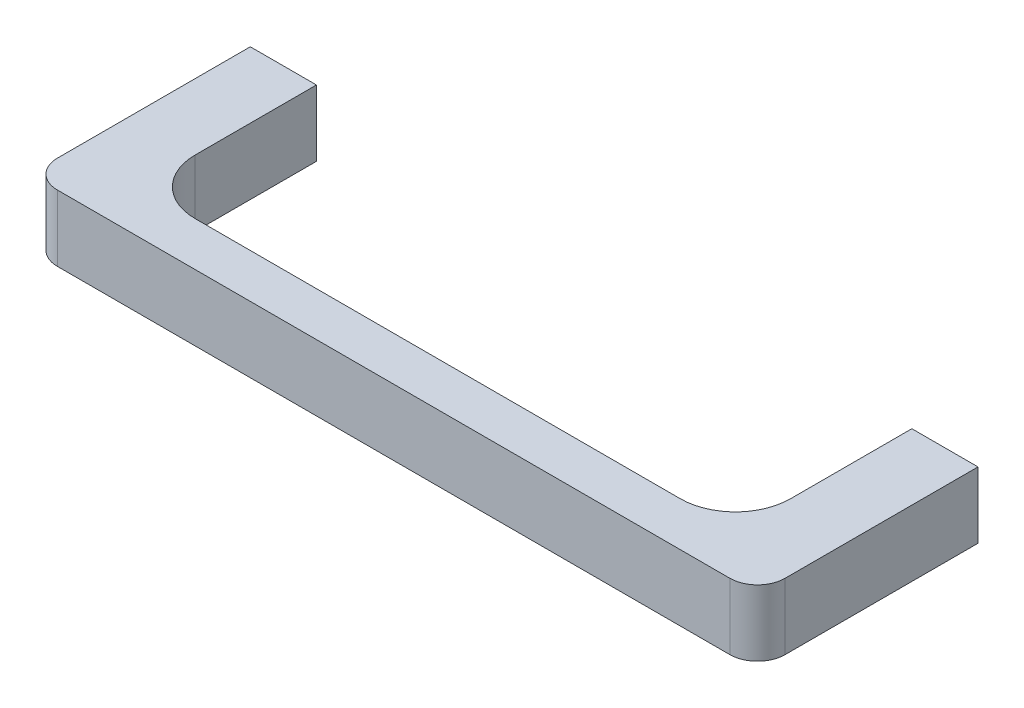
ISO-10303-21;
HEADER;
FILE_DESCRIPTION(('STEP AP214'),'2;1');
FILE_NAME('part.step','',(''),(''),'','','');
FILE_SCHEMA(('AUTOMOTIVE_DESIGN { 1 0 10303 214 1 1 1 1 }'));
ENDSEC;
DATA;
#1=APPLICATION_CONTEXT('core data for automotive mechanical design processes');
#2=APPLICATION_PROTOCOL_DEFINITION('international standard','automotive_design',2000,#1);
#3=PRODUCT_CONTEXT('',#1,'mechanical');
#4=PRODUCT('Part','Part','',(#3));
#5=PRODUCT_RELATED_PRODUCT_CATEGORY('part','',(#4));
#6=PRODUCT_DEFINITION_FORMATION('','',#4);
#7=PRODUCT_DEFINITION_CONTEXT('part definition',#1,'design');
#8=PRODUCT_DEFINITION('design','',#6,#7);
#9=PRODUCT_DEFINITION_SHAPE('','',#8);
#10=(LENGTH_UNIT() NAMED_UNIT(*) SI_UNIT(.MILLI.,.METRE.));
#11=(NAMED_UNIT(*) PLANE_ANGLE_UNIT() SI_UNIT($,.RADIAN.));
#12=(NAMED_UNIT(*) SI_UNIT($,.STERADIAN.) SOLID_ANGLE_UNIT());
#13=UNCERTAINTY_MEASURE_WITH_UNIT(LENGTH_MEASURE(1.E-05),#10,'distance_accuracy_value','');
#14=(GEOMETRIC_REPRESENTATION_CONTEXT(3) GLOBAL_UNCERTAINTY_ASSIGNED_CONTEXT((#13)) GLOBAL_UNIT_ASSIGNED_CONTEXT((#10,
#11,#12)) REPRESENTATION_CONTEXT('',''));
#15=CARTESIAN_POINT('',(0.,0.,0.));
#16=DIRECTION('',(0.,0.,1.));
#17=DIRECTION('',(1.,0.,0.));
#18=AXIS2_PLACEMENT_3D('',#15,#16,#17);
#19=CARTESIAN_POINT('',(-6.,-6.,0.));
#20=DIRECTION('',(0.,0.,1.));
#21=DIRECTION('',(0.,-1.,0.));
#22=AXIS2_PLACEMENT_3D('',#19,#20,#21);
#23=PLANE('',#22);
#24=DIRECTION('',(0.,1.,0.));
#25=VECTOR('',#24,1.);
#26=CARTESIAN_POINT('',(6.,-6.,0.));
#27=LINE('',#26,#25);
#28=CARTESIAN_POINT('',(6.,-6.,0.));
#29=VERTEX_POINT('',#28);
#30=CARTESIAN_POINT('',(6.,6.,0.));
#31=VERTEX_POINT('',#30);
#32=EDGE_CURVE('E196',#29,#31,#27,.T.);
#33=ORIENTED_EDGE('',*,*,#32,.F.);
#34=DIRECTION('',(1.,0.,0.));
#35=VECTOR('',#34,1.);
#36=CARTESIAN_POINT('',(-6.,-6.,0.));
#37=LINE('',#36,#35);
#38=CARTESIAN_POINT('',(-6.,-6.,0.));
#39=VERTEX_POINT('',#38);
#40=EDGE_CURVE('E162',#39,#29,#37,.T.);
#41=ORIENTED_EDGE('',*,*,#40,.F.);
#42=DIRECTION('',(0.,1.,0.));
#43=VECTOR('',#42,1.);
#44=CARTESIAN_POINT('',(-6.,-6.,0.));
#45=LINE('',#44,#43);
#46=CARTESIAN_POINT('',(-6.,6.,0.));
#47=VERTEX_POINT('',#46);
#48=EDGE_CURVE('E198',#39,#47,#45,.T.);
#49=ORIENTED_EDGE('',*,*,#48,.T.);
#50=DIRECTION('',(1.,0.,0.));
#51=VECTOR('',#50,1.);
#52=CARTESIAN_POINT('',(-6.,6.,0.));
#53=LINE('',#52,#51);
#54=EDGE_CURVE('E130',#47,#31,#53,.T.);
#55=ORIENTED_EDGE('',*,*,#54,.T.);
#56=EDGE_LOOP('',(#33,#41,#49,#55));
#57=FACE_BOUND('',#56,.T.);
#58=CARTESIAN_POINT('',(0.,0.,0.));
#59=DIRECTION('',(0.,0.,1.));
#60=DIRECTION('',(0.,-1.,0.));
#61=AXIS2_PLACEMENT_3D('',#58,#59,#60);
#62=CIRCLE('',#61,2.5);
#63=CARTESIAN_POINT('',(0.,-2.5,0.));
#64=VERTEX_POINT('',#63);
#65=EDGE_CURVE('E292',#64,#64,#62,.T.);
#66=ORIENTED_EDGE('',*,*,#65,.T.);
#67=EDGE_LOOP('',(#66));
#68=FACE_BOUND('',#67,.T.);
#69=ADVANCED_FACE('F14',(#57,#68),#23,.F.);
#70=CARTESIAN_POINT('',(121.,-6.,35.));
#71=DIRECTION('',(0.,1.,0.));
#72=DIRECTION('',(-1.,0.,0.));
#73=AXIS2_PLACEMENT_3D('',#70,#71,#72);
#74=CYLINDRICAL_SURFACE('',#73,5.);
#75=DIRECTION('',(0.,1.,0.));
#76=VECTOR('',#75,1.);
#77=CARTESIAN_POINT('',(121.,-6.,40.));
#78=LINE('',#77,#76);
#79=CARTESIAN_POINT('',(121.,-6.,40.));
#80=VERTEX_POINT('',#79);
#81=CARTESIAN_POINT('',(121.,6.,40.));
#82=VERTEX_POINT('',#81);
#83=EDGE_CURVE('E9',#80,#82,#78,.T.);
#84=ORIENTED_EDGE('',*,*,#83,.F.);
#85=CARTESIAN_POINT('',(121.,-6.,35.));
#86=DIRECTION('',(0.,-1.,0.));
#87=DIRECTION('',(1.,0.,0.));
#88=AXIS2_PLACEMENT_3D('',#85,#86,#87);
#89=CIRCLE('',#88,5.);
#90=CARTESIAN_POINT('',(126.,-6.,35.));
#91=VERTEX_POINT('',#90);
#92=EDGE_CURVE('E153',#91,#80,#89,.T.);
#93=ORIENTED_EDGE('',*,*,#92,.F.);
#94=DIRECTION('',(0.,1.,0.));
#95=VECTOR('',#94,1.);
#96=CARTESIAN_POINT('',(126.,-6.,35.));
#97=LINE('',#96,#95);
#98=CARTESIAN_POINT('',(126.,6.,35.));
#99=VERTEX_POINT('',#98);
#100=EDGE_CURVE('E29',#91,#99,#97,.T.);
#101=ORIENTED_EDGE('',*,*,#100,.T.);
#102=CARTESIAN_POINT('',(121.,6.,35.));
#103=DIRECTION('',(0.,-1.,0.));
#104=DIRECTION('',(1.,0.,0.));
#105=AXIS2_PLACEMENT_3D('',#102,#103,#104);
#106=CIRCLE('',#105,5.);
#107=EDGE_CURVE('E113',#99,#82,#106,.T.);
#108=ORIENTED_EDGE('',*,*,#107,.T.);
#109=EDGE_LOOP('',(#84,#93,#101,#108));
#110=FACE_BOUND('',#109,.T.);
#111=ADVANCED_FACE('F114',(#110),#74,.T.);
#112=CARTESIAN_POINT('',(121.,-6.,40.));
#113=DIRECTION('',(0.,0.,-1.));
#114=DIRECTION('',(0.,1.,0.));
#115=AXIS2_PLACEMENT_3D('',#112,#113,#114);
#116=PLANE('',#115);
#117=DIRECTION('',(0.,1.,0.));
#118=VECTOR('',#117,1.);
#119=CARTESIAN_POINT('',(-1.,-6.,40.));
#120=LINE('',#119,#118);
#121=CARTESIAN_POINT('',(-1.,-6.,40.));
#122=VERTEX_POINT('',#121);
#123=CARTESIAN_POINT('',(-1.,6.,40.));
#124=VERTEX_POINT('',#123);
#125=EDGE_CURVE('E22',#122,#124,#120,.T.);
#126=ORIENTED_EDGE('',*,*,#125,.F.);
#127=DIRECTION('',(-1.,0.,0.));
#128=VECTOR('',#127,1.);
#129=CARTESIAN_POINT('',(121.,-6.,40.));
#130=LINE('',#129,#128);
#131=EDGE_CURVE('E109',#80,#122,#130,.T.);
#132=ORIENTED_EDGE('',*,*,#131,.F.);
#133=ORIENTED_EDGE('',*,*,#83,.T.);
#134=DIRECTION('',(-1.,0.,0.));
#135=VECTOR('',#134,1.);
#136=CARTESIAN_POINT('',(121.,6.,40.));
#137=LINE('',#136,#135);
#138=EDGE_CURVE('E106',#82,#124,#137,.T.);
#139=ORIENTED_EDGE('',*,*,#138,.T.);
#140=EDGE_LOOP('',(#126,#132,#133,#139));
#141=FACE_BOUND('',#140,.T.);
#142=ADVANCED_FACE('F16',(#141),#116,.F.);
#143=CARTESIAN_POINT('',(-1.,-6.,35.));
#144=DIRECTION('',(0.,1.,0.));
#145=DIRECTION('',(-1.,0.,0.));
#146=AXIS2_PLACEMENT_3D('',#143,#144,#145);
#147=CYLINDRICAL_SURFACE('',#146,5.);
#148=DIRECTION('',(0.,1.,0.));
#149=VECTOR('',#148,1.);
#150=CARTESIAN_POINT('',(-6.,-6.,35.));
#151=LINE('',#150,#149);
#152=CARTESIAN_POINT('',(-6.,-6.,35.));
#153=VERTEX_POINT('',#152);
#154=CARTESIAN_POINT('',(-6.,6.,35.));
#155=VERTEX_POINT('',#154);
#156=EDGE_CURVE('E200',#153,#155,#151,.T.);
#157=ORIENTED_EDGE('',*,*,#156,.F.);
#158=CARTESIAN_POINT('',(-1.,-6.,35.));
#159=DIRECTION('',(0.,-1.,0.));
#160=DIRECTION('',(1.,0.,0.));
#161=AXIS2_PLACEMENT_3D('',#158,#159,#160);
#162=CIRCLE('',#161,5.);
#163=EDGE_CURVE('E156',#122,#153,#162,.T.);
#164=ORIENTED_EDGE('',*,*,#163,.F.);
#165=ORIENTED_EDGE('',*,*,#125,.T.);
#166=CARTESIAN_POINT('',(-1.,6.,35.));
#167=DIRECTION('',(0.,-1.,0.));
#168=DIRECTION('',(1.,0.,0.));
#169=AXIS2_PLACEMENT_3D('',#166,#167,#168);
#170=CIRCLE('',#169,5.);
#171=EDGE_CURVE('E122',#124,#155,#170,.T.);
#172=ORIENTED_EDGE('',*,*,#171,.T.);
#173=EDGE_LOOP('',(#157,#164,#165,#172));
#174=FACE_BOUND('',#173,.T.);
#175=ADVANCED_FACE('F203',(#174),#147,.T.);
#176=CARTESIAN_POINT('',(-6.,-6.,35.));
#177=DIRECTION('',(1.,0.,0.));
#178=DIRECTION('',(0.,1.,0.));
#179=AXIS2_PLACEMENT_3D('',#176,#177,#178);
#180=PLANE('',#179);
#181=ORIENTED_EDGE('',*,*,#48,.F.);
#182=DIRECTION('',(0.,0.,-1.));
#183=VECTOR('',#182,1.);
#184=CARTESIAN_POINT('',(-6.,-6.,35.));
#185=LINE('',#184,#183);
#186=EDGE_CURVE('E159',#153,#39,#185,.T.);
#187=ORIENTED_EDGE('',*,*,#186,.F.);
#188=ORIENTED_EDGE('',*,*,#156,.T.);
#189=DIRECTION('',(0.,0.,-1.));
#190=VECTOR('',#189,1.);
#191=CARTESIAN_POINT('',(-6.,6.,35.));
#192=LINE('',#191,#190);
#193=EDGE_CURVE('E124',#155,#47,#192,.T.);
#194=ORIENTED_EDGE('',*,*,#193,.T.);
#195=EDGE_LOOP('',(#181,#187,#188,#194));
#196=FACE_BOUND('',#195,.T.);
#197=ADVANCED_FACE('F235',(#196),#180,.F.);
#198=CARTESIAN_POINT('',(6.,-6.,0.));
#199=DIRECTION('',(-1.,0.,0.));
#200=DIRECTION('',(0.,-1.,0.));
#201=AXIS2_PLACEMENT_3D('',#198,#199,#200);
#202=PLANE('',#201);
#203=DIRECTION('',(0.,1.,0.));
#204=VECTOR('',#203,1.);
#205=CARTESIAN_POINT('',(6.,-6.,22.));
#206=LINE('',#205,#204);
#207=CARTESIAN_POINT('',(6.,-6.,22.));
#208=VERTEX_POINT('',#207);
#209=CARTESIAN_POINT('',(6.,6.,22.));
#210=VERTEX_POINT('',#209);
#211=EDGE_CURVE('E194',#208,#210,#206,.T.);
#212=ORIENTED_EDGE('',*,*,#211,.F.);
#213=DIRECTION('',(0.,0.,1.));
#214=VECTOR('',#213,1.);
#215=CARTESIAN_POINT('',(6.,-6.,0.));
#216=LINE('',#215,#214);
#217=EDGE_CURVE('E165',#29,#208,#216,.T.);
#218=ORIENTED_EDGE('',*,*,#217,.F.);
#219=ORIENTED_EDGE('',*,*,#32,.T.);
#220=DIRECTION('',(0.,0.,1.));
#221=VECTOR('',#220,1.);
#222=CARTESIAN_POINT('',(6.,6.,0.));
#223=LINE('',#222,#221);
#224=EDGE_CURVE('E133',#31,#210,#223,.T.);
#225=ORIENTED_EDGE('',*,*,#224,.T.);
#226=EDGE_LOOP('',(#212,#218,#219,#225));
#227=FACE_BOUND('',#226,.T.);
#228=ADVANCED_FACE('F230',(#227),#202,.F.);
#229=CARTESIAN_POINT('',(16.,-6.,22.));
#230=DIRECTION('',(0.,1.,0.));
#231=DIRECTION('',(-1.,0.,0.));
#232=AXIS2_PLACEMENT_3D('',#229,#230,#231);
#233=CYLINDRICAL_SURFACE('',#232,10.);
#234=DIRECTION('',(0.,1.,0.));
#235=VECTOR('',#234,1.);
#236=CARTESIAN_POINT('',(16.,-6.,32.));
#237=LINE('',#236,#235);
#238=CARTESIAN_POINT('',(16.,-6.,32.));
#239=VERTEX_POINT('',#238);
#240=CARTESIAN_POINT('',(16.,6.,32.));
#241=VERTEX_POINT('',#240);
#242=EDGE_CURVE('E192',#239,#241,#237,.T.);
#243=ORIENTED_EDGE('',*,*,#242,.F.);
#244=CARTESIAN_POINT('',(16.,-6.,22.));
#245=DIRECTION('',(0.,-1.,0.));
#246=DIRECTION('',(1.,0.,0.));
#247=AXIS2_PLACEMENT_3D('',#244,#245,#246);
#248=CIRCLE('',#247,10.);
#249=EDGE_CURVE('E168',#239,#208,#248,.T.);
#250=ORIENTED_EDGE('',*,*,#249,.T.);
#251=ORIENTED_EDGE('',*,*,#211,.T.);
#252=CARTESIAN_POINT('',(16.,6.,22.));
#253=DIRECTION('',(0.,-1.,0.));
#254=DIRECTION('',(1.,0.,0.));
#255=AXIS2_PLACEMENT_3D('',#252,#253,#254);
#256=CIRCLE('',#255,10.);
#257=EDGE_CURVE('E136',#241,#210,#256,.T.);
#258=ORIENTED_EDGE('',*,*,#257,.F.);
#259=EDGE_LOOP('',(#243,#250,#251,#258));
#260=FACE_BOUND('',#259,.T.);
#261=ADVANCED_FACE('F226',(#260),#233,.F.);
#262=CARTESIAN_POINT('',(16.,-6.,32.));
#263=DIRECTION('',(0.,0.,1.));
#264=DIRECTION('',(0.,-1.,0.));
#265=AXIS2_PLACEMENT_3D('',#262,#263,#264);
#266=PLANE('',#265);
#267=DIRECTION('',(0.,1.,0.));
#268=VECTOR('',#267,1.);
#269=CARTESIAN_POINT('',(104.,-6.,32.));
#270=LINE('',#269,#268);
#271=CARTESIAN_POINT('',(104.,-6.,32.));
#272=VERTEX_POINT('',#271);
#273=CARTESIAN_POINT('',(104.,6.,32.));
#274=VERTEX_POINT('',#273);
#275=EDGE_CURVE('E190',#272,#274,#270,.T.);
#276=ORIENTED_EDGE('',*,*,#275,.F.);
#277=DIRECTION('',(1.,0.,0.));
#278=VECTOR('',#277,1.);
#279=CARTESIAN_POINT('',(16.,-6.,32.));
#280=LINE('',#279,#278);
#281=EDGE_CURVE('E171',#239,#272,#280,.T.);
#282=ORIENTED_EDGE('',*,*,#281,.F.);
#283=ORIENTED_EDGE('',*,*,#242,.T.);
#284=DIRECTION('',(1.,0.,0.));
#285=VECTOR('',#284,1.);
#286=CARTESIAN_POINT('',(16.,6.,32.));
#287=LINE('',#286,#285);
#288=EDGE_CURVE('E139',#241,#274,#287,.T.);
#289=ORIENTED_EDGE('',*,*,#288,.T.);
#290=EDGE_LOOP('',(#276,#282,#283,#289));
#291=FACE_BOUND('',#290,.T.);
#292=ADVANCED_FACE('F221',(#291),#266,.F.);
#293=CARTESIAN_POINT('',(104.,-6.,22.));
#294=DIRECTION('',(0.,1.,0.));
#295=DIRECTION('',(-1.,0.,0.));
#296=AXIS2_PLACEMENT_3D('',#293,#294,#295);
#297=CYLINDRICAL_SURFACE('',#296,10.);
#298=DIRECTION('',(0.,1.,0.));
#299=VECTOR('',#298,1.);
#300=CARTESIAN_POINT('',(114.,-6.,22.));
#301=LINE('',#300,#299);
#302=CARTESIAN_POINT('',(114.,-6.,22.));
#303=VERTEX_POINT('',#302);
#304=CARTESIAN_POINT('',(114.,6.,22.));
#305=VERTEX_POINT('',#304);
#306=EDGE_CURVE('E188',#303,#305,#301,.T.);
#307=ORIENTED_EDGE('',*,*,#306,.F.);
#308=CARTESIAN_POINT('',(104.,-6.,22.));
#309=DIRECTION('',(0.,-1.,0.));
#310=DIRECTION('',(1.,0.,0.));
#311=AXIS2_PLACEMENT_3D('',#308,#309,#310);
#312=CIRCLE('',#311,10.);
#313=EDGE_CURVE('E174',#303,#272,#312,.T.);
#314=ORIENTED_EDGE('',*,*,#313,.T.);
#315=ORIENTED_EDGE('',*,*,#275,.T.);
#316=CARTESIAN_POINT('',(104.,6.,22.));
#317=DIRECTION('',(0.,-1.,0.));
#318=DIRECTION('',(1.,0.,0.));
#319=AXIS2_PLACEMENT_3D('',#316,#317,#318);
#320=CIRCLE('',#319,10.);
#321=EDGE_CURVE('E142',#305,#274,#320,.T.);
#322=ORIENTED_EDGE('',*,*,#321,.F.);
#323=EDGE_LOOP('',(#307,#314,#315,#322));
#324=FACE_BOUND('',#323,.T.);
#325=ADVANCED_FACE('F218',(#324),#297,.F.);
#326=CARTESIAN_POINT('',(114.,-6.,0.));
#327=DIRECTION('',(-1.,0.,0.));
#328=DIRECTION('',(0.,-1.,0.));
#329=AXIS2_PLACEMENT_3D('',#326,#327,#328);
#330=PLANE('',#329);
#331=DIRECTION('',(0.,1.,0.));
#332=VECTOR('',#331,1.);
#333=CARTESIAN_POINT('',(114.,-6.,0.));
#334=LINE('',#333,#332);
#335=CARTESIAN_POINT('',(114.,-6.,0.));
#336=VERTEX_POINT('',#335);
#337=CARTESIAN_POINT('',(114.,6.,0.));
#338=VERTEX_POINT('',#337);
#339=EDGE_CURVE('E186',#336,#338,#334,.T.);
#340=ORIENTED_EDGE('',*,*,#339,.F.);
#341=DIRECTION('',(0.,0.,1.));
#342=VECTOR('',#341,1.);
#343=CARTESIAN_POINT('',(114.,-6.,0.));
#344=LINE('',#343,#342);
#345=EDGE_CURVE('E177',#336,#303,#344,.T.);
#346=ORIENTED_EDGE('',*,*,#345,.T.);
#347=ORIENTED_EDGE('',*,*,#306,.T.);
#348=DIRECTION('',(0.,0.,1.));
#349=VECTOR('',#348,1.);
#350=CARTESIAN_POINT('',(114.,6.,0.));
#351=LINE('',#350,#349);
#352=EDGE_CURVE('E145',#338,#305,#351,.T.);
#353=ORIENTED_EDGE('',*,*,#352,.F.);
#354=EDGE_LOOP('',(#340,#346,#347,#353));
#355=FACE_BOUND('',#354,.T.);
#356=ADVANCED_FACE('F215',(#355),#330,.T.);
#357=CARTESIAN_POINT('',(126.,-6.,0.));
#358=DIRECTION('',(0.,0.,-1.));
#359=DIRECTION('',(0.,1.,0.));
#360=AXIS2_PLACEMENT_3D('',#357,#358,#359);
#361=PLANE('',#360);
#362=CARTESIAN_POINT('',(120.,0.,0.));
#363=DIRECTION('',(0.,0.,-1.));
#364=DIRECTION('',(0.,1.,0.));
#365=AXIS2_PLACEMENT_3D('',#362,#363,#364);
#366=CIRCLE('',#365,2.5);
#367=CARTESIAN_POINT('',(120.,2.5,0.));
#368=VERTEX_POINT('',#367);
#369=EDGE_CURVE('E291',#368,#368,#366,.T.);
#370=ORIENTED_EDGE('',*,*,#369,.F.);
#371=EDGE_LOOP('',(#370));
#372=FACE_BOUND('',#371,.T.);
#373=DIRECTION('',(0.,1.,0.));
#374=VECTOR('',#373,1.);
#375=CARTESIAN_POINT('',(126.,-6.,0.));
#376=LINE('',#375,#374);
#377=CARTESIAN_POINT('',(126.,-6.,0.));
#378=VERTEX_POINT('',#377);
#379=CARTESIAN_POINT('',(126.,6.,0.));
#380=VERTEX_POINT('',#379);
#381=EDGE_CURVE('E37',#378,#380,#376,.T.);
#382=ORIENTED_EDGE('',*,*,#381,.F.);
#383=DIRECTION('',(-1.,0.,0.));
#384=VECTOR('',#383,1.);
#385=CARTESIAN_POINT('',(126.,-6.,0.));
#386=LINE('',#385,#384);
#387=EDGE_CURVE('E180',#378,#336,#386,.T.);
#388=ORIENTED_EDGE('',*,*,#387,.T.);
#389=ORIENTED_EDGE('',*,*,#339,.T.);
#390=DIRECTION('',(-1.,0.,0.));
#391=VECTOR('',#390,1.);
#392=CARTESIAN_POINT('',(126.,6.,0.));
#393=LINE('',#392,#391);
#394=EDGE_CURVE('E148',#380,#338,#393,.T.);
#395=ORIENTED_EDGE('',*,*,#394,.F.);
#396=EDGE_LOOP('',(#382,#388,#389,#395));
#397=FACE_BOUND('',#396,.T.);
#398=ADVANCED_FACE('F210',(#372,#397),#361,.T.);
#399=CARTESIAN_POINT('',(126.,-6.,35.));
#400=DIRECTION('',(1.,0.,0.));
#401=DIRECTION('',(0.,1.,0.));
#402=AXIS2_PLACEMENT_3D('',#399,#400,#401);
#403=PLANE('',#402);
#404=DIRECTION('',(0.,0.,-1.));
#405=VECTOR('',#404,1.);
#406=CARTESIAN_POINT('',(126.,-6.,35.));
#407=LINE('',#406,#405);
#408=EDGE_CURVE('E182',#91,#378,#407,.T.);
#409=ORIENTED_EDGE('',*,*,#408,.T.);
#410=ORIENTED_EDGE('',*,*,#381,.T.);
#411=DIRECTION('',(0.,0.,-1.));
#412=VECTOR('',#411,1.);
#413=CARTESIAN_POINT('',(126.,6.,35.));
#414=LINE('',#413,#412);
#415=EDGE_CURVE('E151',#99,#380,#414,.T.);
#416=ORIENTED_EDGE('',*,*,#415,.F.);
#417=ORIENTED_EDGE('',*,*,#100,.F.);
#418=EDGE_LOOP('',(#409,#410,#416,#417));
#419=FACE_BOUND('',#418,.T.);
#420=ADVANCED_FACE('F209',(#419),#403,.T.);
#421=CARTESIAN_POINT('',(121.,-6.,35.));
#422=DIRECTION('',(0.,-1.,0.));
#423=DIRECTION('',(1.,0.,0.));
#424=AXIS2_PLACEMENT_3D('',#421,#422,#423);
#425=PLANE('',#424);
#426=ORIENTED_EDGE('',*,*,#92,.T.);
#427=ORIENTED_EDGE('',*,*,#131,.T.);
#428=ORIENTED_EDGE('',*,*,#163,.T.);
#429=ORIENTED_EDGE('',*,*,#186,.T.);
#430=ORIENTED_EDGE('',*,*,#40,.T.);
#431=ORIENTED_EDGE('',*,*,#217,.T.);
#432=ORIENTED_EDGE('',*,*,#249,.F.);
#433=ORIENTED_EDGE('',*,*,#281,.T.);
#434=ORIENTED_EDGE('',*,*,#313,.F.);
#435=ORIENTED_EDGE('',*,*,#345,.F.);
#436=ORIENTED_EDGE('',*,*,#387,.F.);
#437=ORIENTED_EDGE('',*,*,#408,.F.);
#438=EDGE_LOOP('',(#426,#427,#428,#429,#430,#431,#432,#433,#434,#435,#436,#437));
#439=FACE_BOUND('',#438,.T.);
#440=ADVANCED_FACE('F205',(#439),#425,.T.);
#441=CARTESIAN_POINT('',(121.,6.,35.));
#442=DIRECTION('',(0.,-1.,0.));
#443=DIRECTION('',(1.,0.,0.));
#444=AXIS2_PLACEMENT_3D('',#441,#442,#443);
#445=PLANE('',#444);
#446=ORIENTED_EDGE('',*,*,#107,.F.);
#447=ORIENTED_EDGE('',*,*,#415,.T.);
#448=ORIENTED_EDGE('',*,*,#394,.T.);
#449=ORIENTED_EDGE('',*,*,#352,.T.);
#450=ORIENTED_EDGE('',*,*,#321,.T.);
#451=ORIENTED_EDGE('',*,*,#288,.F.);
#452=ORIENTED_EDGE('',*,*,#257,.T.);
#453=ORIENTED_EDGE('',*,*,#224,.F.);
#454=ORIENTED_EDGE('',*,*,#54,.F.);
#455=ORIENTED_EDGE('',*,*,#193,.F.);
#456=ORIENTED_EDGE('',*,*,#171,.F.);
#457=ORIENTED_EDGE('',*,*,#138,.F.);
#458=EDGE_LOOP('',(#446,#447,#448,#449,#450,#451,#452,#453,#454,#455,#456,#457));
#459=FACE_BOUND('',#458,.T.);
#460=ADVANCED_FACE('F119',(#459),#445,.F.);
#461=CARTESIAN_POINT('',(120.,0.,10.));
#462=DIRECTION('',(0.,0.,-1.));
#463=DIRECTION('',(0.,1.,0.));
#464=AXIS2_PLACEMENT_3D('',#461,#462,#463);
#465=CYLINDRICAL_SURFACE('',#464,2.5);
#466=CARTESIAN_POINT('',(120.,0.,10.));
#467=DIRECTION('',(0.,0.,-1.));
#468=DIRECTION('',(0.,1.,0.));
#469=AXIS2_PLACEMENT_3D('',#466,#467,#468);
#470=CIRCLE('',#469,2.5);
#471=CARTESIAN_POINT('',(120.,2.5,10.));
#472=VERTEX_POINT('',#471);
#473=EDGE_CURVE('E117',#472,#472,#470,.T.);
#474=ORIENTED_EDGE('',*,*,#473,.F.);
#475=EDGE_LOOP('',(#474));
#476=FACE_BOUND('',#475,.T.);
#477=ORIENTED_EDGE('',*,*,#369,.T.);
#478=EDGE_LOOP('',(#477));
#479=FACE_BOUND('',#478,.T.);
#480=ADVANCED_FACE('F270',(#476,#479),#465,.F.);
#481=CARTESIAN_POINT('',(120.,0.,10.));
#482=DIRECTION('',(0.,0.,-1.));
#483=DIRECTION('',(0.,1.,0.));
#484=AXIS2_PLACEMENT_3D('',#481,#482,#483);
#485=PLANE('',#484);
#486=ORIENTED_EDGE('',*,*,#473,.T.);
#487=EDGE_LOOP('',(#486));
#488=FACE_BOUND('',#487,.T.);
#489=ADVANCED_FACE('F271',(#488),#485,.T.);
#490=CARTESIAN_POINT('',(0.,0.,10.));
#491=DIRECTION('',(0.,0.,-1.));
#492=DIRECTION('',(0.,1.,0.));
#493=AXIS2_PLACEMENT_3D('',#490,#491,#492);
#494=CYLINDRICAL_SURFACE('',#493,2.5);
#495=CARTESIAN_POINT('',(0.,0.,10.));
#496=DIRECTION('',(0.,0.,1.));
#497=DIRECTION('',(0.,-1.,0.));
#498=AXIS2_PLACEMENT_3D('',#495,#496,#497);
#499=CIRCLE('',#498,2.5);
#500=CARTESIAN_POINT('',(0.,-2.5,10.));
#501=VERTEX_POINT('',#500);
#502=EDGE_CURVE('E290',#501,#501,#499,.T.);
#503=ORIENTED_EDGE('',*,*,#502,.T.);
#504=EDGE_LOOP('',(#503));
#505=FACE_BOUND('',#504,.T.);
#506=ORIENTED_EDGE('',*,*,#65,.F.);
#507=EDGE_LOOP('',(#506));
#508=FACE_BOUND('',#507,.T.);
#509=ADVANCED_FACE('F278',(#505,#508),#494,.F.);
#510=CARTESIAN_POINT('',(0.,0.,10.));
#511=DIRECTION('',(0.,0.,1.));
#512=DIRECTION('',(0.,-1.,0.));
#513=AXIS2_PLACEMENT_3D('',#510,#511,#512);
#514=PLANE('',#513);
#515=ORIENTED_EDGE('',*,*,#502,.F.);
#516=EDGE_LOOP('',(#515));
#517=FACE_BOUND('',#516,.T.);
#518=ADVANCED_FACE('F275',(#517),#514,.F.);
#519=CLOSED_SHELL('',(#69,#111,#142,#175,#197,#228,#261,#292,#325,#356,#398,#420,#440,#460,#480,
#489,#509,#518));
#520=MANIFOLD_SOLID_BREP('B1',#519);
#521=ADVANCED_BREP_SHAPE_REPRESENTATION('',(#18,#520),#14);
#522=SHAPE_DEFINITION_REPRESENTATION(#9,#521);
ENDSEC;
END-ISO-10303-21;
